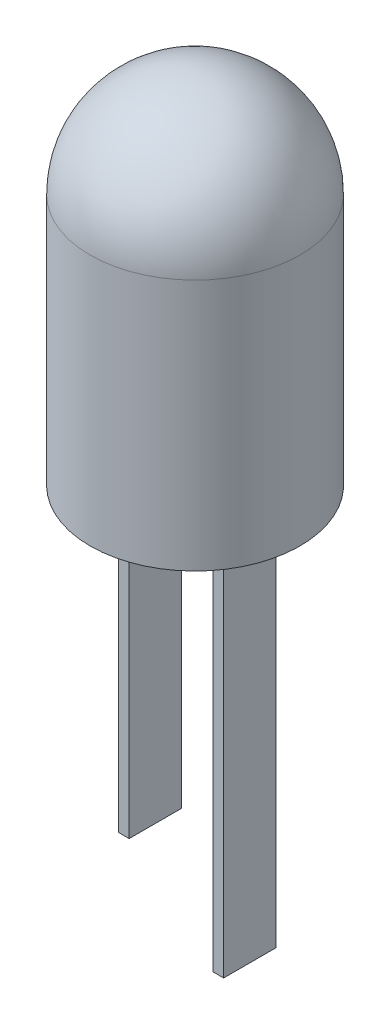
from build123d import *

# Parameters (mm, degrees)
SKETCH1_R           = 10
BOSS_EXTRUDE2_DEPTH = 24
DOME1_FACE_RADIUS   = 10
DOME1_HEIGHT        = 10
SKETCH6_W           = 1
SKETCH6_H           = 5
BOSS_EXTRUDE3_DEPTH = 30
SKETCH8_W           = 1
SKETCH8_H           = 5
BOSS_EXTRUDE4_DEPTH = 37


with BuildPart() as part:
    # Sketch1 → Boss-Extrude2 (new body)
    with BuildSketch(Plane(origin=(0, 0, 0), x_dir=(1, 0, 0), z_dir=(0, 1, 0))):
        with Locations(Location((0, 0, 0), (0, 0, 270))):
            Circle(SKETCH1_R)
    extrude(amount=BOSS_EXTRUDE2_DEPTH)

    # Dome1: a dome of height H over a round flat face of radius A is a cap of a sphere of radius (A * A + H * H) / (2 * H)
    dome1_r = (DOME1_FACE_RADIUS * DOME1_FACE_RADIUS + DOME1_HEIGHT * DOME1_HEIGHT) / (2 * DOME1_HEIGHT)
    dome1_base = Plane((0, 24, 0), z_dir=(0, 1, 0))
    with Locations(dome1_base.offset(DOME1_HEIGHT - dome1_r)):
        dome1_ball = Sphere(dome1_r, mode=Mode.PRIVATE)
    add(split(dome1_ball, bisect_by=dome1_base, keep=Keep.TOP, mode=Mode.PRIVATE))

    # Sketch6 → Boss-Extrude3 (add)
    with BuildSketch(Plane(origin=(0, 0, 0), x_dir=(1, 0, 0), z_dir=(0, 1, 0))):
        with Locations((-4.5, 0.223003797)):
            Rectangle(SKETCH6_W, SKETCH6_H)
    extrude(amount=-BOSS_EXTRUDE3_DEPTH)

    # Sketch8 → Boss-Extrude4 (add)
    with BuildSketch(Plane.XZ):
        with Locations((4.5, -0.223003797)):
            Rectangle(SKETCH8_W, SKETCH8_H)
    extrude(amount=BOSS_EXTRUDE4_DEPTH)


solid = part.part
